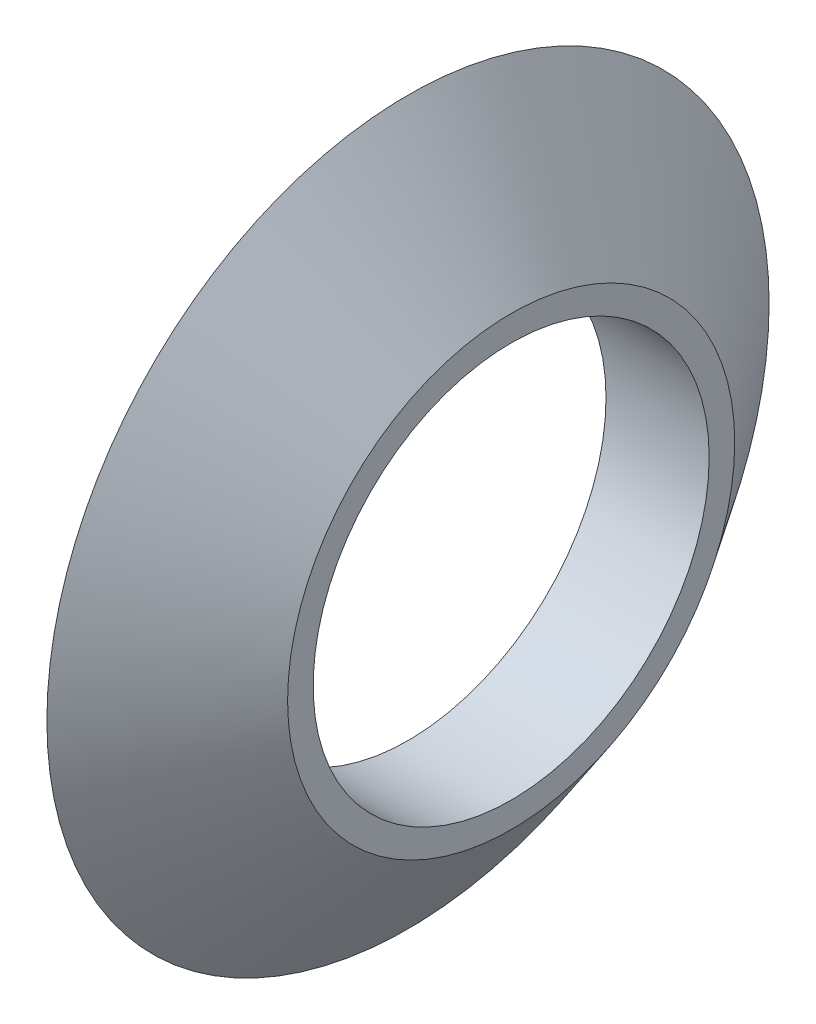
ISO-10303-21;
HEADER;
FILE_DESCRIPTION(('STEP AP214'),'2;1');
FILE_NAME('part.step','',(''),(''),'','','');
FILE_SCHEMA(('AUTOMOTIVE_DESIGN { 1 0 10303 214 1 1 1 1 }'));
ENDSEC;
DATA;
#1=APPLICATION_CONTEXT('core data for automotive mechanical design processes');
#2=APPLICATION_PROTOCOL_DEFINITION('international standard','automotive_design',2000,#1);
#3=PRODUCT_CONTEXT('',#1,'mechanical');
#4=PRODUCT('Part','Part','',(#3));
#5=PRODUCT_RELATED_PRODUCT_CATEGORY('part','',(#4));
#6=PRODUCT_DEFINITION_FORMATION('','',#4);
#7=PRODUCT_DEFINITION_CONTEXT('part definition',#1,'design');
#8=PRODUCT_DEFINITION('design','',#6,#7);
#9=PRODUCT_DEFINITION_SHAPE('','',#8);
#10=(LENGTH_UNIT() NAMED_UNIT(*) SI_UNIT(.MILLI.,.METRE.));
#11=(NAMED_UNIT(*) PLANE_ANGLE_UNIT() SI_UNIT($,.RADIAN.));
#12=(NAMED_UNIT(*) SI_UNIT($,.STERADIAN.) SOLID_ANGLE_UNIT());
#13=UNCERTAINTY_MEASURE_WITH_UNIT(LENGTH_MEASURE(1.E-05),#10,'distance_accuracy_value','');
#14=(GEOMETRIC_REPRESENTATION_CONTEXT(3) GLOBAL_UNCERTAINTY_ASSIGNED_CONTEXT((#13)) GLOBAL_UNIT_ASSIGNED_CONTEXT((#10,
#11,#12)) REPRESENTATION_CONTEXT('',''));
#15=CARTESIAN_POINT('',(0.,0.,0.));
#16=DIRECTION('',(0.,0.,1.));
#17=DIRECTION('',(1.,0.,0.));
#18=AXIS2_PLACEMENT_3D('',#15,#16,#17);
#19=CARTESIAN_POINT('',(-4.24,5.65333333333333,0.));
#20=DIRECTION('',(-1.,0.,0.));
#21=DIRECTION('',(0.,0.,1.));
#22=AXIS2_PLACEMENT_3D('',#19,#20,#21);
#23=PLANE('',#22);
#24=CARTESIAN_POINT('',(-4.24,0.,0.));
#25=DIRECTION('',(1.,0.,0.));
#26=DIRECTION('',(0.,0.,-1.));
#27=AXIS2_PLACEMENT_3D('',#24,#25,#26);
#28=CIRCLE('',#27,3.1);
#29=CARTESIAN_POINT('',(-4.24,0.,-3.1));
#30=VERTEX_POINT('',#29);
#31=EDGE_CURVE('E10',#30,#30,#28,.T.);
#32=ORIENTED_EDGE('',*,*,#31,.T.);
#33=EDGE_LOOP('',(#32));
#34=FACE_BOUND('',#33,.T.);
#35=CARTESIAN_POINT('',(-4.24,0.,0.));
#36=DIRECTION('',(1.,0.,0.));
#37=DIRECTION('',(0.,0.,-1.));
#38=AXIS2_PLACEMENT_3D('',#35,#36,#37);
#39=CIRCLE('',#38,5.65333333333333);
#40=CARTESIAN_POINT('',(-4.24,0.,-5.65333333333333));
#41=VERTEX_POINT('',#40);
#42=EDGE_CURVE('E47',#41,#41,#39,.T.);
#43=ORIENTED_EDGE('',*,*,#42,.F.);
#44=EDGE_LOOP('',(#43));
#45=FACE_BOUND('',#44,.T.);
#46=ADVANCED_FACE('F33',(#34,#45),#23,.T.);
#47=CARTESIAN_POINT('',(0.,0.,0.));
#48=DIRECTION('',(1.,0.,0.));
#49=DIRECTION('',(0.,0.,-1.));
#50=AXIS2_PLACEMENT_3D('',#47,#48,#49);
#51=CYLINDRICAL_SURFACE('',#50,3.1);
#52=CARTESIAN_POINT('',(-2.625,0.,0.));
#53=DIRECTION('',(1.,0.,0.));
#54=DIRECTION('',(0.,0.,-1.));
#55=AXIS2_PLACEMENT_3D('',#52,#53,#54);
#56=CIRCLE('',#55,3.1);
#57=CARTESIAN_POINT('',(-2.625,0.,-3.1));
#58=VERTEX_POINT('',#57);
#59=EDGE_CURVE('E39',#58,#58,#56,.T.);
#60=ORIENTED_EDGE('',*,*,#59,.T.);
#61=EDGE_LOOP('',(#60));
#62=FACE_BOUND('',#61,.T.);
#63=ORIENTED_EDGE('',*,*,#31,.F.);
#64=EDGE_LOOP('',(#63));
#65=FACE_BOUND('',#64,.T.);
#66=ADVANCED_FACE('F57',(#62,#65),#51,.F.);
#67=CARTESIAN_POINT('',(-2.625,3.5,0.));
#68=DIRECTION('',(1.,0.,0.));
#69=DIRECTION('',(0.,0.,-1.));
#70=AXIS2_PLACEMENT_3D('',#67,#68,#69);
#71=PLANE('',#70);
#72=CARTESIAN_POINT('',(-2.625,0.,0.));
#73=DIRECTION('',(1.,0.,0.));
#74=DIRECTION('',(0.,0.,-1.));
#75=AXIS2_PLACEMENT_3D('',#72,#73,#74);
#76=CIRCLE('',#75,3.5);
#77=CARTESIAN_POINT('',(-2.625,0.,-3.5));
#78=VERTEX_POINT('',#77);
#79=EDGE_CURVE('E43',#78,#78,#76,.T.);
#80=ORIENTED_EDGE('',*,*,#79,.T.);
#81=EDGE_LOOP('',(#80));
#82=FACE_BOUND('',#81,.T.);
#83=ORIENTED_EDGE('',*,*,#59,.F.);
#84=EDGE_LOOP('',(#83));
#85=FACE_BOUND('',#84,.T.);
#86=ADVANCED_FACE('F61',(#82,#85),#71,.T.);
#87=CARTESIAN_POINT('',(-2.625,0.,0.));
#88=DIRECTION('',(-1.,0.,0.));
#89=DIRECTION('',(0.,0.,1.));
#90=AXIS2_PLACEMENT_3D('',#87,#88,#89);
#91=CONICAL_SURFACE('',#90,3.5,0.927295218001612);
#92=ORIENTED_EDGE('',*,*,#42,.T.);
#93=EDGE_LOOP('',(#92));
#94=FACE_BOUND('',#93,.T.);
#95=ORIENTED_EDGE('',*,*,#79,.F.);
#96=EDGE_LOOP('',(#95));
#97=FACE_BOUND('',#96,.T.);
#98=ADVANCED_FACE('F53',(#94,#97),#91,.T.);
#99=CLOSED_SHELL('',(#46,#66,#86,#98));
#100=MANIFOLD_SOLID_BREP('B2',#99);
#101=ADVANCED_BREP_SHAPE_REPRESENTATION('',(#18,#100),#14);
#102=SHAPE_DEFINITION_REPRESENTATION(#9,#101);
ENDSEC;
END-ISO-10303-21;
